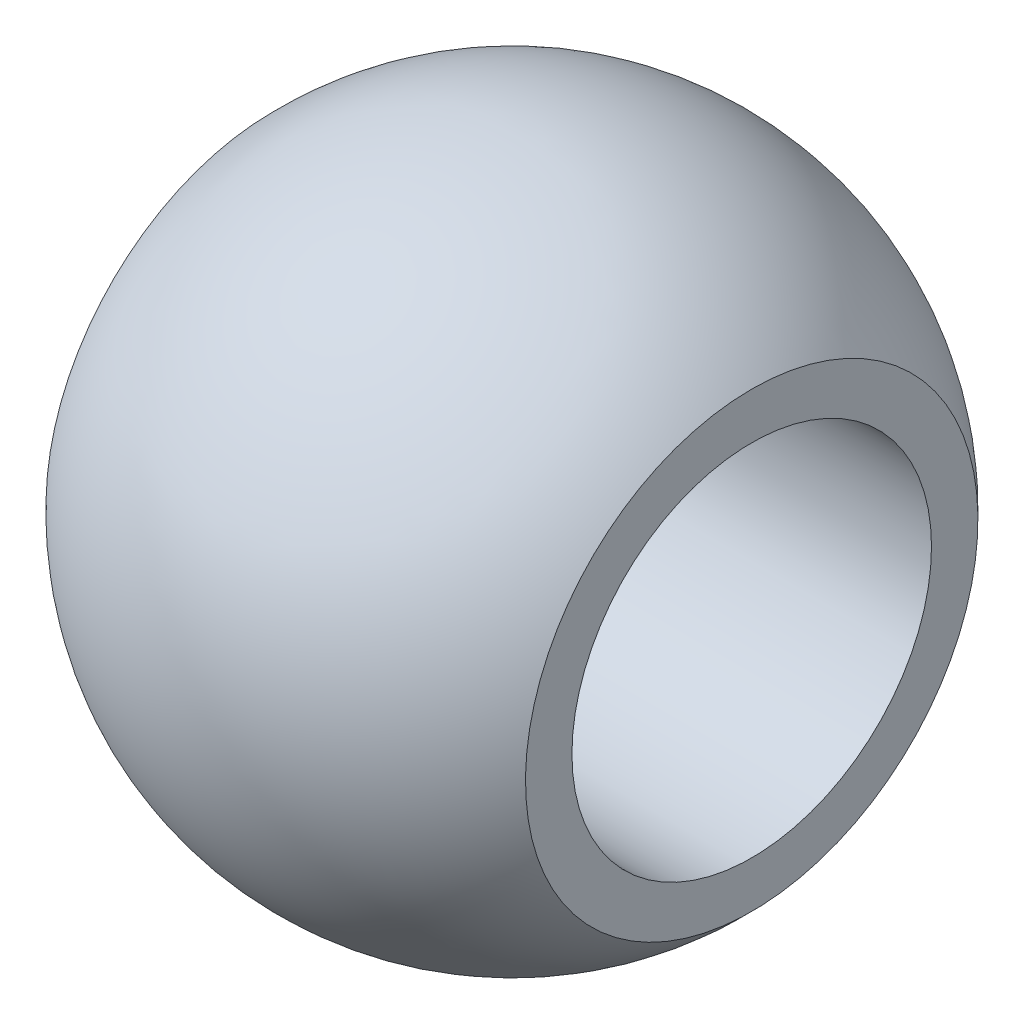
from build123d import *


with BuildPart() as part:
    # Esquisse1 → Base-R_volution (revolve)
    with BuildSketch(Plane.XY):
        with BuildLine():
            Line((-8, 7.549834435), (-8, 6))
            Line((-8, 6), (8, 6))
            Line((8, 6), (8, 7.549834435))
            ThreePointArc((8, 7.549834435), (0, 11), (-8, 7.549834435))
        make_face()
    revolve(axis=Axis((0, 0, 0), (-1, 0, 0)))


solid = part.part
